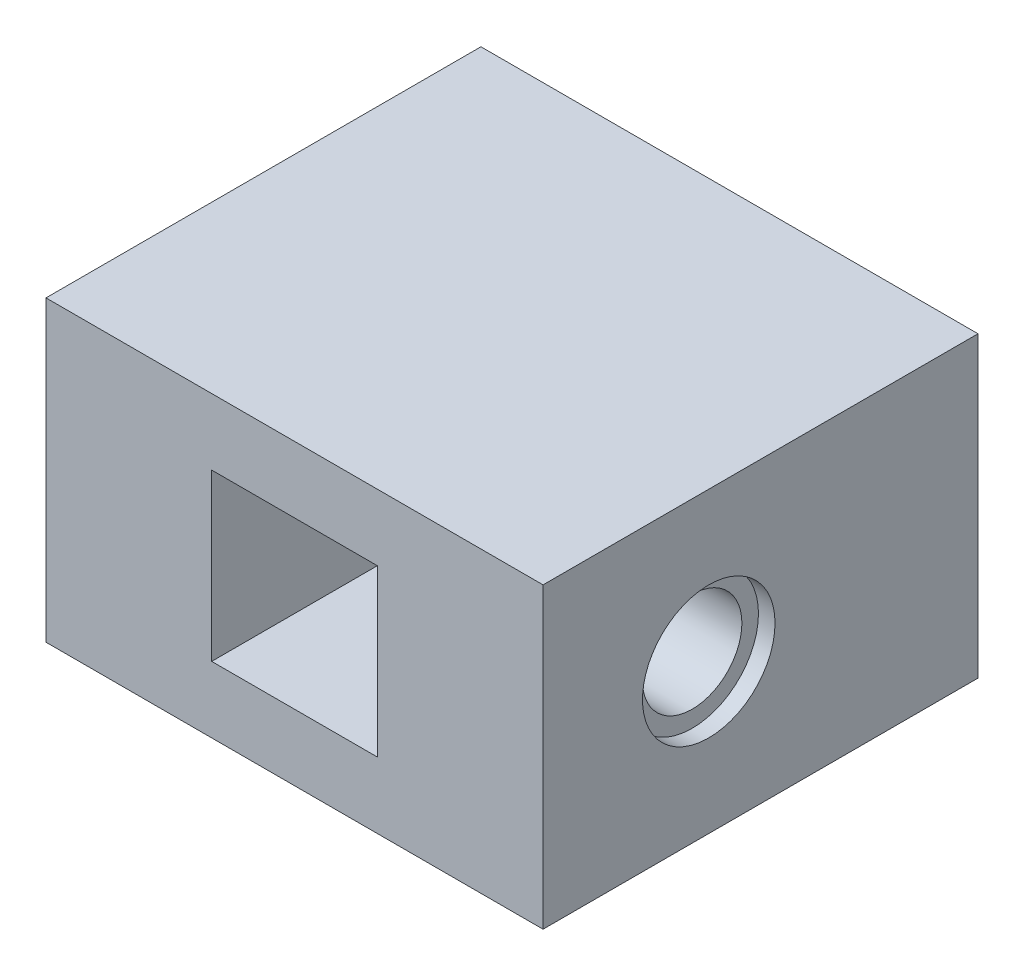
from build123d import *

# Parameters (mm, degrees)
SKETCH1_W                               = 24
SKETCH1_H                               = 21
BOSS_EXTRUDE1_DEPTH                     = 14.4
SKETCH10_W                              = 8
SKETCH10_H                              = 8
CUT_EXTRUDE1_DEPTH                      = 29.148889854
CBORE_FOR_M5_HEX_HEAD_BOLT2_D           = 4.8
CBORE_FOR_M5_HEX_HEAD_BOLT2_DEPTH       = 8
CBORE_FOR_M5_HEX_HEAD_BOLT2_CBORE_D     = 6.4
CBORE_FOR_M5_HEX_HEAD_BOLT2_CBORE_DEPTH = 0.8


with BuildPart() as part:
    # Sketch1 → Boss-Extrude1 (new body)
    with BuildSketch(Plane(origin=(0, 0, 0), x_dir=(1, 0, 0), z_dir=(0, 1, 0))):
        with Locations((0, 2.5)):
            Rectangle(SKETCH1_W, SKETCH1_H)
    extrude(amount=BOSS_EXTRUDE1_DEPTH)

    # Sketch10 → Cut-Extrude1 (cut, through all)
    with BuildSketch(Plane.XY.offset(-13)):
        with Locations((0, 7.2)):
            Rectangle(SKETCH10_W, SKETCH10_H)
    extrude(amount=CUT_EXTRUDE1_DEPTH, mode=Mode.SUBTRACT)

    # CBORE for M5 Hex Head Bolt2
    with Locations(Plane.ZY.offset(12)):
        with Locations((0, 7.2)):
            cbore_for_m5_hex_head_bolt2 = CounterBoreHole(CBORE_FOR_M5_HEX_HEAD_BOLT2_D / 2, CBORE_FOR_M5_HEX_HEAD_BOLT2_CBORE_D / 2, CBORE_FOR_M5_HEX_HEAD_BOLT2_CBORE_DEPTH, depth=CBORE_FOR_M5_HEX_HEAD_BOLT2_DEPTH)

    # Mirror1: CBORE for M5 Hex Head Bolt2 across plane
    add(cbore_for_m5_hex_head_bolt2.mirror(Plane(origin=(0, 0, 0), x_dir=(0, 0, 1), z_dir=(1, 0, 0))), mode=Mode.SUBTRACT)


solid = part.part
